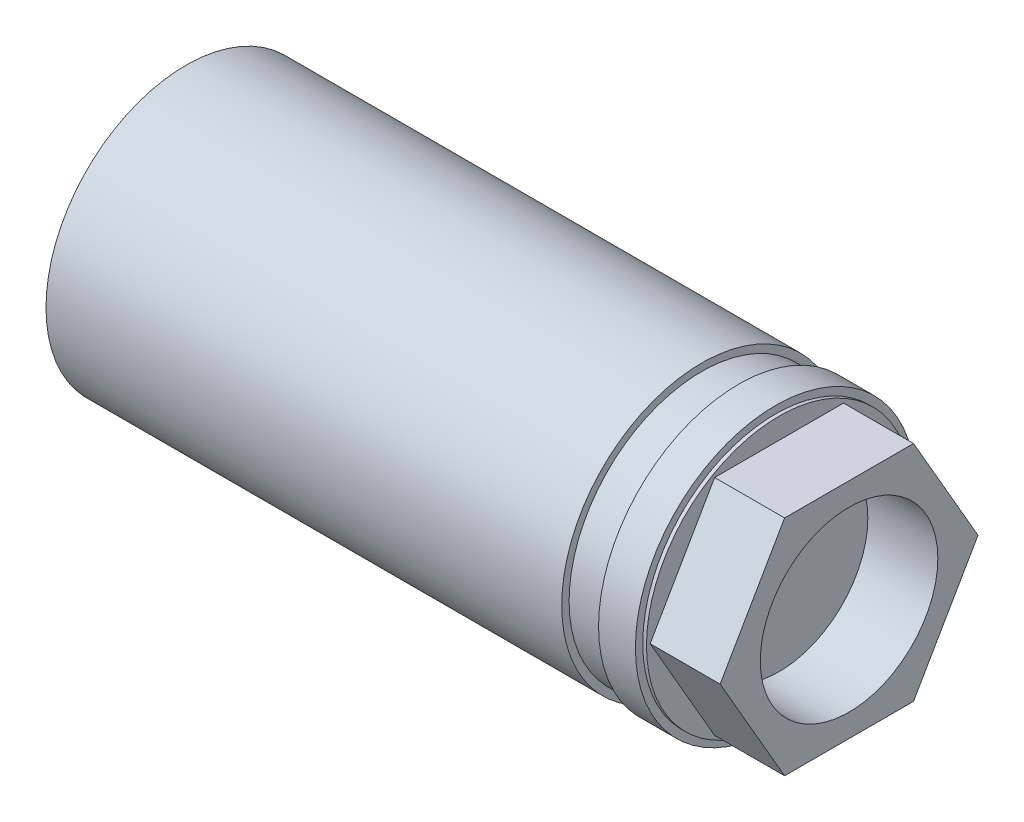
from build123d import *

# Parameters (mm, degrees)
SALIENTE_EXTRUIR1_DEPTH = 9.5
CROQUIS3_R              = 12.05
CORTAR_EXTRUIR1_DEPTH   = 9.5


with BuildPart() as part:
    # Croquis1 → Revoluci_n1 (revolve)
    with BuildSketch(Plane.XY, mode=Mode.PRIVATE) as revoluci_n1_sk:
        Polygon((0, 0), (0, 19), (70, 19), (70, 18), (75, 18), (75, 19), (80, 19), (80, 18), (80.5, 18), (80.5, 0), align=None)
    revolve(revoluci_n1_sk.sketch.rotate(Axis((0, 0, 0), (1, 0, 0)), 90), axis=Axis((0, 0, 0), (1, 0, 0)))

    # Croquis2 → Saliente-Extruir1 (add)
    with BuildSketch(Plane(origin=(80.5, 0, 0), x_dir=(0, 0, -1), z_dir=(1, 0, 0))):
        Polygon((-8.749797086, 15.155561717), (-17.499999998, 0.000234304), (-8.750202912, -15.155327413), (8.749797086, -15.155561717), (17.499999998, -0.000234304), (8.750202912, 15.155327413), align=None)
    extrude(amount=SALIENTE_EXTRUIR1_DEPTH)

    # Croquis3 → Cortar-Extruir1 (cut)
    with BuildSketch(Plane(origin=(90, 0, 0), x_dir=(0, 0, -1), z_dir=(1, 0, 0))):
        Circle(CROQUIS3_R)
    extrude(amount=-CORTAR_EXTRUIR1_DEPTH, mode=Mode.SUBTRACT)


solid = part.part
